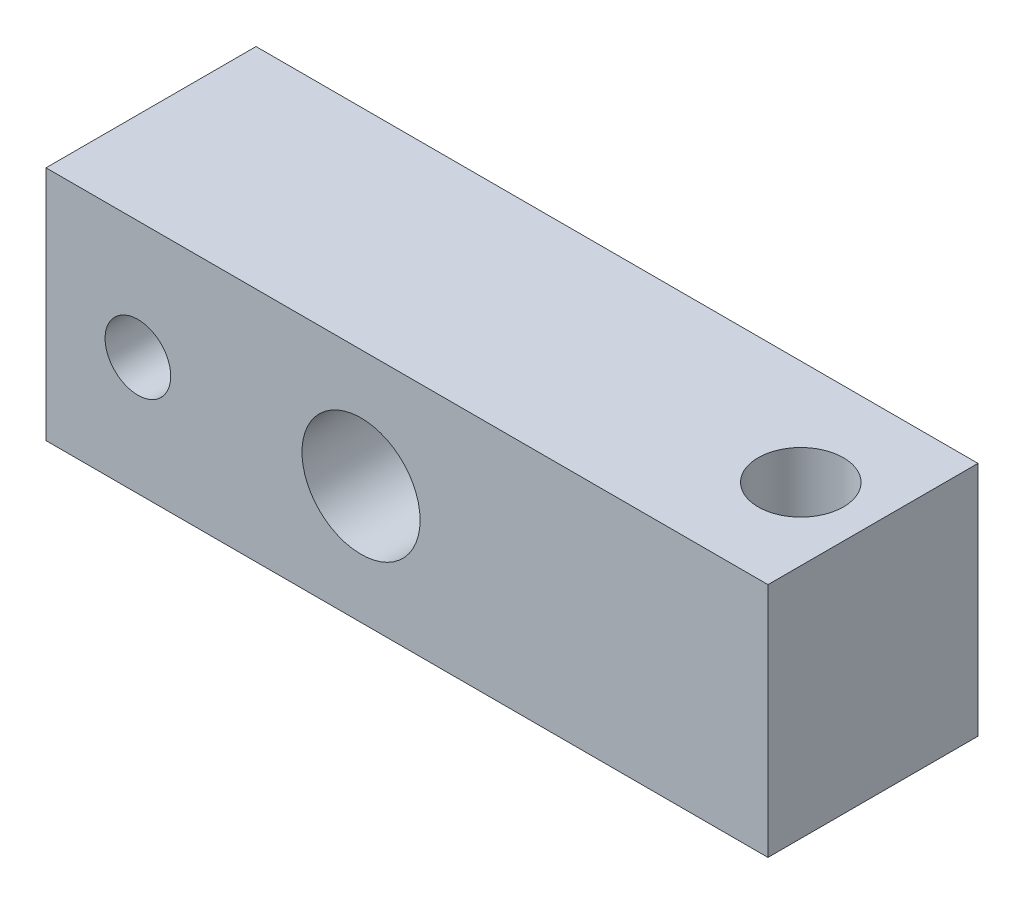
ISO-10303-21;
HEADER;
FILE_DESCRIPTION(('STEP AP214'),'2;1');
FILE_NAME('part.step','',(''),(''),'','','');
FILE_SCHEMA(('AUTOMOTIVE_DESIGN { 1 0 10303 214 1 1 1 1 }'));
ENDSEC;
DATA;
#1=APPLICATION_CONTEXT('core data for automotive mechanical design processes');
#2=APPLICATION_PROTOCOL_DEFINITION('international standard','automotive_design',2000,#1);
#3=PRODUCT_CONTEXT('',#1,'mechanical');
#4=PRODUCT('Part','Part','',(#3));
#5=PRODUCT_RELATED_PRODUCT_CATEGORY('part','',(#4));
#6=PRODUCT_DEFINITION_FORMATION('','',#4);
#7=PRODUCT_DEFINITION_CONTEXT('part definition',#1,'design');
#8=PRODUCT_DEFINITION('design','',#6,#7);
#9=PRODUCT_DEFINITION_SHAPE('','',#8);
#10=(LENGTH_UNIT() NAMED_UNIT(*) SI_UNIT(.MILLI.,.METRE.));
#11=(NAMED_UNIT(*) PLANE_ANGLE_UNIT() SI_UNIT($,.RADIAN.));
#12=(NAMED_UNIT(*) SI_UNIT($,.STERADIAN.) SOLID_ANGLE_UNIT());
#13=UNCERTAINTY_MEASURE_WITH_UNIT(LENGTH_MEASURE(1.E-05),#10,'distance_accuracy_value','');
#14=(GEOMETRIC_REPRESENTATION_CONTEXT(3) GLOBAL_UNCERTAINTY_ASSIGNED_CONTEXT((#13)) GLOBAL_UNIT_ASSIGNED_CONTEXT((#10,
#11,#12)) REPRESENTATION_CONTEXT('',''));
#15=CARTESIAN_POINT('',(0.,0.,0.));
#16=DIRECTION('',(0.,0.,1.));
#17=DIRECTION('',(1.,0.,0.));
#18=AXIS2_PLACEMENT_3D('',#15,#16,#17);
#19=CARTESIAN_POINT('',(8.5,0.500000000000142,-12.9999999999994));
#20=DIRECTION('',(0.,-1.,0.));
#21=DIRECTION('',(1.,0.,0.));
#22=AXIS2_PLACEMENT_3D('',#19,#20,#21);
#23=PLANE('',#22);
#24=CARTESIAN_POINT('',(8.5,0.500000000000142,-12.9999999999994));
#25=DIRECTION('',(0.,-1.,0.));
#26=DIRECTION('',(1.,0.,0.));
#27=AXIS2_PLACEMENT_3D('',#24,#25,#26);
#28=CIRCLE('',#27,3.25);
#29=CARTESIAN_POINT('',(11.75,0.500000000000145,-12.9999999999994));
#30=VERTEX_POINT('',#29);
#31=EDGE_CURVE('E77',#30,#30,#28,.F.);
#32=ORIENTED_EDGE('',*,*,#31,.T.);
#33=EDGE_LOOP('',(#32));
#34=FACE_BOUND('',#33,.T.);
#35=CARTESIAN_POINT('',(8.5,0.500000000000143,-12.9999999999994));
#36=DIRECTION('',(0.,-1.,0.));
#37=DIRECTION('',(1.,0.,0.));
#38=AXIS2_PLACEMENT_3D('',#35,#36,#37);
#39=CIRCLE('',#38,5.);
#40=CARTESIAN_POINT('',(13.5,0.500000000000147,-12.9999999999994));
#41=VERTEX_POINT('',#40);
#42=EDGE_CURVE('E19',#41,#41,#39,.T.);
#43=ORIENTED_EDGE('',*,*,#42,.T.);
#44=EDGE_LOOP('',(#43));
#45=FACE_BOUND('',#44,.T.);
#46=ADVANCED_FACE('F16',(#34,#45),#23,.T.);
#47=CARTESIAN_POINT('',(8.5,-5.49999999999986,-12.9999999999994));
#48=DIRECTION('',(0.,-1.,0.));
#49=DIRECTION('',(1.,0.,0.));
#50=AXIS2_PLACEMENT_3D('',#47,#48,#49);
#51=CYLINDRICAL_SURFACE('',#50,5.);
#52=ORIENTED_EDGE('',*,*,#42,.F.);
#53=EDGE_LOOP('',(#52));
#54=FACE_BOUND('',#53,.T.);
#55=CARTESIAN_POINT('',(8.5,-5.49999999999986,-12.9999999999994));
#56=DIRECTION('',(0.,-1.,0.));
#57=DIRECTION('',(1.,0.,0.));
#58=AXIS2_PLACEMENT_3D('',#55,#56,#57);
#59=CIRCLE('',#58,5.);
#60=CARTESIAN_POINT('',(13.5,-5.49999999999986,-12.9999999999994));
#61=VERTEX_POINT('',#60);
#62=EDGE_CURVE('E85',#61,#61,#59,.T.);
#63=ORIENTED_EDGE('',*,*,#62,.T.);
#64=EDGE_LOOP('',(#63));
#65=FACE_BOUND('',#64,.T.);
#66=ADVANCED_FACE('F111',(#54,#65),#51,.F.);
#67=CARTESIAN_POINT('',(13.,15.,-5.));
#68=DIRECTION('',(0.,0.,-1.));
#69=DIRECTION('',(0.,1.,0.));
#70=AXIS2_PLACEMENT_3D('',#67,#68,#69);
#71=PLANE('',#70);
#72=CARTESIAN_POINT('',(-34.,3.50000000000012,-5.));
#73=DIRECTION('',(0.,0.,1.));
#74=DIRECTION('',(1.,0.,0.));
#75=AXIS2_PLACEMENT_3D('',#72,#73,#74);
#76=CIRCLE('',#75,2.5);
#77=CARTESIAN_POINT('',(-31.5,3.50000000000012,-5.));
#78=VERTEX_POINT('',#77);
#79=EDGE_CURVE('E231',#78,#78,#76,.T.);
#80=ORIENTED_EDGE('',*,*,#79,.F.);
#81=EDGE_LOOP('',(#80));
#82=FACE_BOUND('',#81,.T.);
#83=CARTESIAN_POINT('',(-17.,3.50000000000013,-5.));
#84=DIRECTION('',(0.,0.,1.));
#85=DIRECTION('',(1.,0.,0.));
#86=AXIS2_PLACEMENT_3D('',#83,#84,#85);
#87=CIRCLE('',#86,4.5);
#88=CARTESIAN_POINT('',(-12.5,3.50000000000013,-5.));
#89=VERTEX_POINT('',#88);
#90=EDGE_CURVE('E224',#89,#89,#87,.T.);
#91=ORIENTED_EDGE('',*,*,#90,.F.);
#92=EDGE_LOOP('',(#91));
#93=FACE_BOUND('',#92,.T.);
#94=DIRECTION('',(-1.,0.,0.));
#95=VECTOR('',#94,1.);
#96=CARTESIAN_POINT('',(17.,-5.49999999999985,-5.));
#97=LINE('',#96,#95);
#98=CARTESIAN_POINT('',(-41.,-5.49999999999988,-5.));
#99=VERTEX_POINT('',#98);
#100=CARTESIAN_POINT('',(14.,-5.49999999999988,-5.));
#101=VERTEX_POINT('',#100);
#102=EDGE_CURVE('E86',#99,#101,#97,.F.);
#103=ORIENTED_EDGE('',*,*,#102,.T.);
#104=DIRECTION('',(0.,-1.,0.));
#105=VECTOR('',#104,1.);
#106=CARTESIAN_POINT('',(14.,12.5,-5.));
#107=LINE('',#106,#105);
#108=CARTESIAN_POINT('',(14.,12.5,-5.));
#109=VERTEX_POINT('',#108);
#110=EDGE_CURVE('E60',#109,#101,#107,.T.);
#111=ORIENTED_EDGE('',*,*,#110,.F.);
#112=DIRECTION('',(1.,0.,0.));
#113=VECTOR('',#112,1.);
#114=CARTESIAN_POINT('',(13.,12.5,-5.));
#115=LINE('',#114,#113);
#116=CARTESIAN_POINT('',(-41.,12.5,-5.));
#117=VERTEX_POINT('',#116);
#118=EDGE_CURVE('E67',#109,#117,#115,.F.);
#119=ORIENTED_EDGE('',*,*,#118,.T.);
#120=DIRECTION('',(0.,1.,0.));
#121=VECTOR('',#120,1.);
#122=CARTESIAN_POINT('',(-41.,-5.49999999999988,-5.));
#123=LINE('',#122,#121);
#124=EDGE_CURVE('E78',#99,#117,#123,.T.);
#125=ORIENTED_EDGE('',*,*,#124,.F.);
#126=EDGE_LOOP('',(#103,#111,#119,#125));
#127=FACE_BOUND('',#126,.T.);
#128=ADVANCED_FACE('F100',(#82,#93,#127),#71,.F.);
#129=CARTESIAN_POINT('',(8.5,-5.49999999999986,-12.9999999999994));
#130=DIRECTION('',(0.,-1.,0.));
#131=DIRECTION('',(1.,0.,0.));
#132=AXIS2_PLACEMENT_3D('',#129,#130,#131);
#133=CYLINDRICAL_SURFACE('',#132,3.25);
#134=CARTESIAN_POINT('',(8.5,12.5,-12.9999999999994));
#135=DIRECTION('',(0.,-1.,0.));
#136=DIRECTION('',(1.,0.,0.));
#137=AXIS2_PLACEMENT_3D('',#134,#135,#136);
#138=CIRCLE('',#137,3.25);
#139=CARTESIAN_POINT('',(11.75,12.5,-12.9999999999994));
#140=VERTEX_POINT('',#139);
#141=EDGE_CURVE('E83',#140,#140,#138,.F.);
#142=ORIENTED_EDGE('',*,*,#141,.T.);
#143=EDGE_LOOP('',(#142));
#144=FACE_BOUND('',#143,.T.);
#145=ORIENTED_EDGE('',*,*,#31,.F.);
#146=EDGE_LOOP('',(#145));
#147=FACE_BOUND('',#146,.T.);
#148=ADVANCED_FACE('F97',(#144,#147),#133,.F.);
#149=CARTESIAN_POINT('',(17.,-5.49999999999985,-2.5976));
#150=DIRECTION('',(0.,1.,0.));
#151=DIRECTION('',(-1.,0.,0.));
#152=AXIS2_PLACEMENT_3D('',#149,#150,#151);
#153=PLANE('',#152);
#154=ORIENTED_EDGE('',*,*,#62,.F.);
#155=EDGE_LOOP('',(#154));
#156=FACE_BOUND('',#155,.T.);
#157=DIRECTION('',(1.,0.,0.));
#158=VECTOR('',#157,1.);
#159=CARTESIAN_POINT('',(13.,-5.49999999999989,-20.9999999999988));
#160=LINE('',#159,#158);
#161=CARTESIAN_POINT('',(-41.,-5.49999999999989,-20.9999999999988));
#162=VERTEX_POINT('',#161);
#163=CARTESIAN_POINT('',(14.,-5.49999999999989,-20.9999999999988));
#164=VERTEX_POINT('',#163);
#165=EDGE_CURVE('E24',#162,#164,#160,.T.);
#166=ORIENTED_EDGE('',*,*,#165,.T.);
#167=DIRECTION('',(0.,0.,1.));
#168=VECTOR('',#167,1.);
#169=CARTESIAN_POINT('',(14.,-5.49999999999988,-21.0000000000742));
#170=LINE('',#169,#168);
#171=EDGE_CURVE('E32',#164,#101,#170,.T.);
#172=ORIENTED_EDGE('',*,*,#171,.T.);
#173=ORIENTED_EDGE('',*,*,#102,.F.);
#174=DIRECTION('',(0.,0.,1.));
#175=VECTOR('',#174,1.);
#176=CARTESIAN_POINT('',(-41.,-5.49999999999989,-20.9999999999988));
#177=LINE('',#176,#175);
#178=EDGE_CURVE('E218',#162,#99,#177,.T.);
#179=ORIENTED_EDGE('',*,*,#178,.F.);
#180=EDGE_LOOP('',(#166,#172,#173,#179));
#181=FACE_BOUND('',#180,.T.);
#182=ADVANCED_FACE('F99',(#156,#181),#153,.F.);
#183=CARTESIAN_POINT('',(13.,12.5,-35.));
#184=DIRECTION('',(0.,-1.,0.));
#185=DIRECTION('',(0.,0.,-1.));
#186=AXIS2_PLACEMENT_3D('',#183,#184,#185);
#187=PLANE('',#186);
#188=ORIENTED_EDGE('',*,*,#141,.F.);
#189=EDGE_LOOP('',(#188));
#190=FACE_BOUND('',#189,.T.);
#191=ORIENTED_EDGE('',*,*,#118,.F.);
#192=DIRECTION('',(0.,0.,1.));
#193=VECTOR('',#192,1.);
#194=CARTESIAN_POINT('',(14.,12.5,-21.0000000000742));
#195=LINE('',#194,#193);
#196=CARTESIAN_POINT('',(14.,12.5,-21.0000000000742));
#197=VERTEX_POINT('',#196);
#198=EDGE_CURVE('E57',#197,#109,#195,.T.);
#199=ORIENTED_EDGE('',*,*,#198,.F.);
#200=DIRECTION('',(1.,0.,0.));
#201=VECTOR('',#200,1.);
#202=CARTESIAN_POINT('',(13.,12.5,-20.9999999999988));
#203=LINE('',#202,#201);
#204=CARTESIAN_POINT('',(-41.,12.5,-20.9999999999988));
#205=VERTEX_POINT('',#204);
#206=EDGE_CURVE('E11',#197,#205,#203,.F.);
#207=ORIENTED_EDGE('',*,*,#206,.T.);
#208=DIRECTION('',(0.,0.,-1.));
#209=VECTOR('',#208,1.);
#210=CARTESIAN_POINT('',(-41.,12.5,-5.));
#211=LINE('',#210,#209);
#212=EDGE_CURVE('E74',#117,#205,#211,.T.);
#213=ORIENTED_EDGE('',*,*,#212,.F.);
#214=EDGE_LOOP('',(#191,#199,#207,#213));
#215=FACE_BOUND('',#214,.T.);
#216=ADVANCED_FACE('F64',(#190,#215),#187,.F.);
#217=CARTESIAN_POINT('',(13.,15.,-20.9999999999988));
#218=DIRECTION('',(0.,0.,1.));
#219=DIRECTION('',(1.,0.,0.));
#220=AXIS2_PLACEMENT_3D('',#217,#218,#219);
#221=PLANE('',#220);
#222=CARTESIAN_POINT('',(-34.,3.50000000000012,-21.0000000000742));
#223=DIRECTION('',(0.,0.,1.));
#224=DIRECTION('',(1.,0.,0.));
#225=AXIS2_PLACEMENT_3D('',#222,#223,#224);
#226=CIRCLE('',#225,2.5);
#227=CARTESIAN_POINT('',(-31.5,3.50000000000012,-21.0000000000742));
#228=VERTEX_POINT('',#227);
#229=EDGE_CURVE('E229',#228,#228,#226,.T.);
#230=ORIENTED_EDGE('',*,*,#229,.T.);
#231=EDGE_LOOP('',(#230));
#232=FACE_BOUND('',#231,.T.);
#233=CARTESIAN_POINT('',(-17.,3.50000000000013,-21.0000000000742));
#234=DIRECTION('',(0.,0.,1.));
#235=DIRECTION('',(1.,0.,0.));
#236=AXIS2_PLACEMENT_3D('',#233,#234,#235);
#237=CIRCLE('',#236,4.5);
#238=CARTESIAN_POINT('',(-12.5,3.50000000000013,-21.0000000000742));
#239=VERTEX_POINT('',#238);
#240=EDGE_CURVE('E221',#239,#239,#237,.T.);
#241=ORIENTED_EDGE('',*,*,#240,.T.);
#242=EDGE_LOOP('',(#241));
#243=FACE_BOUND('',#242,.T.);
#244=ORIENTED_EDGE('',*,*,#206,.F.);
#245=DIRECTION('',(0.,-1.,0.));
#246=VECTOR('',#245,1.);
#247=CARTESIAN_POINT('',(14.,12.5,-21.0000000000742));
#248=LINE('',#247,#246);
#249=EDGE_CURVE('E54',#197,#164,#248,.T.);
#250=ORIENTED_EDGE('',*,*,#249,.T.);
#251=ORIENTED_EDGE('',*,*,#165,.F.);
#252=DIRECTION('',(0.,-1.,0.));
#253=VECTOR('',#252,1.);
#254=CARTESIAN_POINT('',(-41.,12.5,-20.9999999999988));
#255=LINE('',#254,#253);
#256=EDGE_CURVE('E70',#205,#162,#255,.T.);
#257=ORIENTED_EDGE('',*,*,#256,.F.);
#258=EDGE_LOOP('',(#244,#250,#251,#257));
#259=FACE_BOUND('',#258,.T.);
#260=ADVANCED_FACE('F69',(#232,#243,#259),#221,.F.);
#261=CARTESIAN_POINT('',(-41.,0.,0.));
#262=DIRECTION('',(-1.,0.,0.));
#263=DIRECTION('',(0.,0.,1.));
#264=AXIS2_PLACEMENT_3D('',#261,#262,#263);
#265=PLANE('',#264);
#266=ORIENTED_EDGE('',*,*,#178,.T.);
#267=ORIENTED_EDGE('',*,*,#124,.T.);
#268=ORIENTED_EDGE('',*,*,#212,.T.);
#269=ORIENTED_EDGE('',*,*,#256,.T.);
#270=EDGE_LOOP('',(#266,#267,#268,#269));
#271=FACE_BOUND('',#270,.T.);
#272=ADVANCED_FACE('F115',(#271),#265,.T.);
#273=CARTESIAN_POINT('',(-17.,3.50000000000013,-5.));
#274=DIRECTION('',(0.,0.,1.));
#275=DIRECTION('',(1.,0.,0.));
#276=AXIS2_PLACEMENT_3D('',#273,#274,#275);
#277=CYLINDRICAL_SURFACE('',#276,4.5);
#278=ORIENTED_EDGE('',*,*,#240,.F.);
#279=EDGE_LOOP('',(#278));
#280=FACE_BOUND('',#279,.T.);
#281=ORIENTED_EDGE('',*,*,#90,.T.);
#282=EDGE_LOOP('',(#281));
#283=FACE_BOUND('',#282,.T.);
#284=ADVANCED_FACE('F123',(#280,#283),#277,.F.);
#285=CARTESIAN_POINT('',(-34.,3.50000000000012,-5.));
#286=DIRECTION('',(0.,0.,1.));
#287=DIRECTION('',(1.,0.,0.));
#288=AXIS2_PLACEMENT_3D('',#285,#286,#287);
#289=CYLINDRICAL_SURFACE('',#288,2.5);
#290=ORIENTED_EDGE('',*,*,#229,.F.);
#291=EDGE_LOOP('',(#290));
#292=FACE_BOUND('',#291,.T.);
#293=ORIENTED_EDGE('',*,*,#79,.T.);
#294=EDGE_LOOP('',(#293));
#295=FACE_BOUND('',#294,.T.);
#296=ADVANCED_FACE('F132',(#292,#295),#289,.F.);
#297=CARTESIAN_POINT('',(14.,12.5,-21.0000000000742));
#298=DIRECTION('',(-1.,0.,0.));
#299=DIRECTION('',(0.,0.,1.));
#300=AXIS2_PLACEMENT_3D('',#297,#298,#299);
#301=PLANE('',#300);
#302=ORIENTED_EDGE('',*,*,#110,.T.);
#303=ORIENTED_EDGE('',*,*,#171,.F.);
#304=ORIENTED_EDGE('',*,*,#249,.F.);
#305=ORIENTED_EDGE('',*,*,#198,.T.);
#306=EDGE_LOOP('',(#302,#303,#304,#305));
#307=FACE_BOUND('',#306,.T.);
#308=ADVANCED_FACE('F56',(#307),#301,.F.);
#309=CLOSED_SHELL('',(#46,#66,#128,#148,#182,#216,#260,#272,#284,#296,#308));
#310=MANIFOLD_SOLID_BREP('B1',#309);
#311=ADVANCED_BREP_SHAPE_REPRESENTATION('',(#18,#310),#14);
#312=SHAPE_DEFINITION_REPRESENTATION(#9,#311);
ENDSEC;
END-ISO-10303-21;
